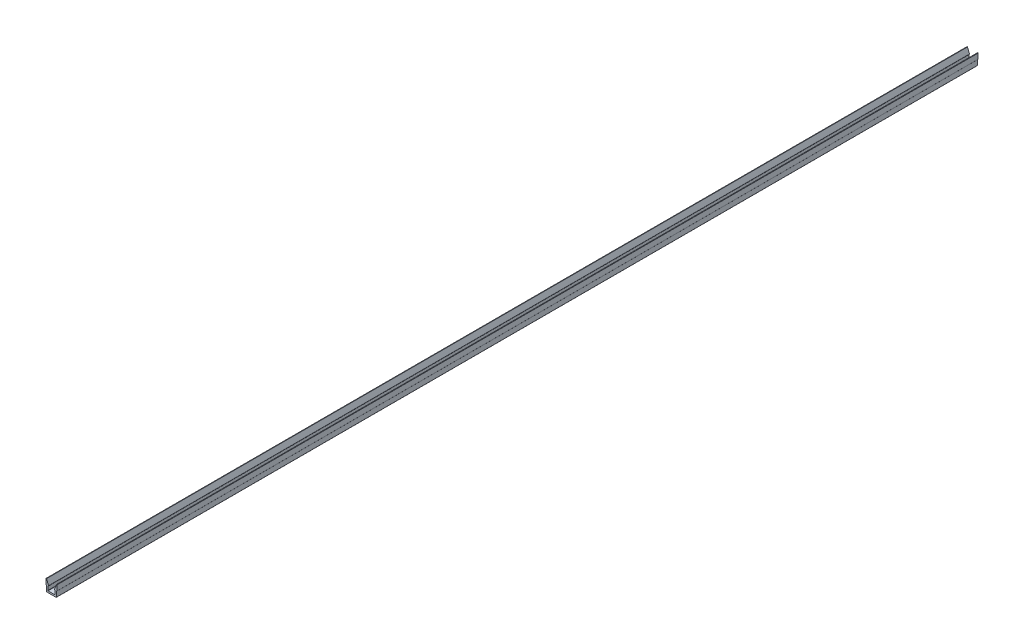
ISO-10303-21;
HEADER;
FILE_DESCRIPTION(('STEP AP214'),'2;1');
FILE_NAME('part.step','',(''),(''),'','','');
FILE_SCHEMA(('AUTOMOTIVE_DESIGN { 1 0 10303 214 1 1 1 1 }'));
ENDSEC;
DATA;
#1=APPLICATION_CONTEXT('core data for automotive mechanical design processes');
#2=APPLICATION_PROTOCOL_DEFINITION('international standard','automotive_design',2000,#1);
#3=PRODUCT_CONTEXT('',#1,'mechanical');
#4=PRODUCT('Part','Part','',(#3));
#5=PRODUCT_RELATED_PRODUCT_CATEGORY('part','',(#4));
#6=PRODUCT_DEFINITION_FORMATION('','',#4);
#7=PRODUCT_DEFINITION_CONTEXT('part definition',#1,'design');
#8=PRODUCT_DEFINITION('design','',#6,#7);
#9=PRODUCT_DEFINITION_SHAPE('','',#8);
#10=(LENGTH_UNIT() NAMED_UNIT(*) SI_UNIT(.MILLI.,.METRE.));
#11=(NAMED_UNIT(*) PLANE_ANGLE_UNIT() SI_UNIT($,.RADIAN.));
#12=(NAMED_UNIT(*) SI_UNIT($,.STERADIAN.) SOLID_ANGLE_UNIT());
#13=UNCERTAINTY_MEASURE_WITH_UNIT(LENGTH_MEASURE(1.E-05),#10,'distance_accuracy_value','');
#14=(GEOMETRIC_REPRESENTATION_CONTEXT(3) GLOBAL_UNCERTAINTY_ASSIGNED_CONTEXT((#13)) GLOBAL_UNIT_ASSIGNED_CONTEXT((#10,
#11,#12)) REPRESENTATION_CONTEXT('',''));
#15=CARTESIAN_POINT('',(0.,0.,0.));
#16=DIRECTION('',(0.,0.,1.));
#17=DIRECTION('',(1.,0.,0.));
#18=AXIS2_PLACEMENT_3D('',#15,#16,#17);
#19=CARTESIAN_POINT('',(2.032,3.175,508.));
#20=DIRECTION('',(1.,0.,0.));
#21=DIRECTION('',(0.,1.,0.));
#22=AXIS2_PLACEMENT_3D('',#19,#20,#21);
#23=PLANE('',#22);
#24=DIRECTION('',(0.,-1.,0.));
#25=VECTOR('',#24,1.);
#26=CARTESIAN_POINT('',(2.032,3.175,0.));
#27=LINE('',#26,#25);
#28=CARTESIAN_POINT('',(2.032,3.175,0.));
#29=VERTEX_POINT('',#28);
#30=CARTESIAN_POINT('',(2.032,1.016,0.));
#31=VERTEX_POINT('',#30);
#32=EDGE_CURVE('E214',#29,#31,#27,.T.);
#33=ORIENTED_EDGE('',*,*,#32,.T.);
#34=DIRECTION('',(0.,0.,-1.));
#35=VECTOR('',#34,1.);
#36=CARTESIAN_POINT('',(2.032,1.016,508.));
#37=LINE('',#36,#35);
#38=CARTESIAN_POINT('',(2.032,1.016,508.));
#39=VERTEX_POINT('',#38);
#40=EDGE_CURVE('E9',#39,#31,#37,.T.);
#41=ORIENTED_EDGE('',*,*,#40,.F.);
#42=DIRECTION('',(0.,-1.,0.));
#43=VECTOR('',#42,1.);
#44=CARTESIAN_POINT('',(2.032,3.175,508.));
#45=LINE('',#44,#43);
#46=CARTESIAN_POINT('',(2.032,3.175,508.));
#47=VERTEX_POINT('',#46);
#48=EDGE_CURVE('E285',#47,#39,#45,.T.);
#49=ORIENTED_EDGE('',*,*,#48,.F.);
#50=DIRECTION('',(0.,0.,-1.));
#51=VECTOR('',#50,1.);
#52=CARTESIAN_POINT('',(2.032,3.175,508.));
#53=LINE('',#52,#51);
#54=EDGE_CURVE('E227',#47,#29,#53,.T.);
#55=ORIENTED_EDGE('',*,*,#54,.T.);
#56=EDGE_LOOP('',(#33,#41,#49,#55));
#57=FACE_BOUND('',#56,.T.);
#58=ADVANCED_FACE('F14',(#57),#23,.F.);
#59=CARTESIAN_POINT('',(1.905,1.016,508.));
#60=DIRECTION('',(0.,0.,-1.));
#61=DIRECTION('',(-1.,0.,0.));
#62=AXIS2_PLACEMENT_3D('',#59,#60,#61);
#63=CYLINDRICAL_SURFACE('',#62,0.127);
#64=CARTESIAN_POINT('',(1.905,1.016,0.));
#65=DIRECTION('',(0.,0.,-1.));
#66=DIRECTION('',(-1.,0.,0.));
#67=AXIS2_PLACEMENT_3D('',#64,#65,#66);
#68=CIRCLE('',#67,0.127);
#69=CARTESIAN_POINT('',(1.905,0.889,0.));
#70=VERTEX_POINT('',#69);
#71=EDGE_CURVE('E210',#31,#70,#68,.T.);
#72=ORIENTED_EDGE('',*,*,#71,.T.);
#73=DIRECTION('',(0.,0.,-1.));
#74=VECTOR('',#73,1.);
#75=CARTESIAN_POINT('',(1.905,0.889,508.));
#76=LINE('',#75,#74);
#77=CARTESIAN_POINT('',(1.905,0.889,508.));
#78=VERTEX_POINT('',#77);
#79=EDGE_CURVE('E21',#78,#70,#76,.T.);
#80=ORIENTED_EDGE('',*,*,#79,.F.);
#81=CARTESIAN_POINT('',(1.905,1.016,508.));
#82=DIRECTION('',(0.,0.,-1.));
#83=DIRECTION('',(-1.,0.,0.));
#84=AXIS2_PLACEMENT_3D('',#81,#82,#83);
#85=CIRCLE('',#84,0.127);
#86=EDGE_CURVE('E223',#39,#78,#85,.T.);
#87=ORIENTED_EDGE('',*,*,#86,.F.);
#88=ORIENTED_EDGE('',*,*,#40,.T.);
#89=EDGE_LOOP('',(#72,#80,#87,#88));
#90=FACE_BOUND('',#89,.T.);
#91=ADVANCED_FACE('F222',(#90),#63,.F.);
#92=CARTESIAN_POINT('',(1.905,0.889,508.));
#93=DIRECTION('',(0.,-1.,0.));
#94=DIRECTION('',(0.,0.,-1.));
#95=AXIS2_PLACEMENT_3D('',#92,#93,#94);
#96=PLANE('',#95);
#97=DIRECTION('',(-1.,0.,0.));
#98=VECTOR('',#97,1.);
#99=CARTESIAN_POINT('',(1.905,0.889,0.));
#100=LINE('',#99,#98);
#101=CARTESIAN_POINT('',(-1.905,0.889,0.));
#102=VERTEX_POINT('',#101);
#103=EDGE_CURVE('E216',#70,#102,#100,.T.);
#104=ORIENTED_EDGE('',*,*,#103,.T.);
#105=DIRECTION('',(0.,0.,-1.));
#106=VECTOR('',#105,1.);
#107=CARTESIAN_POINT('',(-1.905,0.889,508.));
#108=LINE('',#107,#106);
#109=CARTESIAN_POINT('',(-1.905,0.889,508.));
#110=VERTEX_POINT('',#109);
#111=EDGE_CURVE('E421',#110,#102,#108,.T.);
#112=ORIENTED_EDGE('',*,*,#111,.F.);
#113=DIRECTION('',(-1.,0.,0.));
#114=VECTOR('',#113,1.);
#115=CARTESIAN_POINT('',(1.905,0.889,508.));
#116=LINE('',#115,#114);
#117=EDGE_CURVE('E288',#78,#110,#116,.T.);
#118=ORIENTED_EDGE('',*,*,#117,.F.);
#119=ORIENTED_EDGE('',*,*,#79,.T.);
#120=EDGE_LOOP('',(#104,#112,#118,#119));
#121=FACE_BOUND('',#120,.T.);
#122=ADVANCED_FACE('F425',(#121),#96,.F.);
#123=CARTESIAN_POINT('',(-1.905,1.016,508.));
#124=DIRECTION('',(0.,0.,-1.));
#125=DIRECTION('',(-1.,0.,0.));
#126=AXIS2_PLACEMENT_3D('',#123,#124,#125);
#127=CYLINDRICAL_SURFACE('',#126,0.127);
#128=CARTESIAN_POINT('',(-1.905,1.016,0.));
#129=DIRECTION('',(0.,0.,-1.));
#130=DIRECTION('',(1.,0.,0.));
#131=AXIS2_PLACEMENT_3D('',#128,#129,#130);
#132=CIRCLE('',#131,0.127);
#133=CARTESIAN_POINT('',(-2.032,1.016,0.));
#134=VERTEX_POINT('',#133);
#135=EDGE_CURVE('E231',#102,#134,#132,.T.);
#136=ORIENTED_EDGE('',*,*,#135,.T.);
#137=DIRECTION('',(0.,0.,-1.));
#138=VECTOR('',#137,1.);
#139=CARTESIAN_POINT('',(-2.032,1.016,508.));
#140=LINE('',#139,#138);
#141=CARTESIAN_POINT('',(-2.032,1.016,508.));
#142=VERTEX_POINT('',#141);
#143=EDGE_CURVE('E418',#142,#134,#140,.T.);
#144=ORIENTED_EDGE('',*,*,#143,.F.);
#145=CARTESIAN_POINT('',(-1.905,1.016,508.));
#146=DIRECTION('',(0.,0.,-1.));
#147=DIRECTION('',(1.,0.,0.));
#148=AXIS2_PLACEMENT_3D('',#145,#146,#147);
#149=CIRCLE('',#148,0.127);
#150=EDGE_CURVE('E290',#110,#142,#149,.T.);
#151=ORIENTED_EDGE('',*,*,#150,.F.);
#152=ORIENTED_EDGE('',*,*,#111,.T.);
#153=EDGE_LOOP('',(#136,#144,#151,#152));
#154=FACE_BOUND('',#153,.T.);
#155=ADVANCED_FACE('F433',(#154),#127,.F.);
#156=CARTESIAN_POINT('',(-2.032,3.175,508.));
#157=DIRECTION('',(-1.,0.,0.));
#158=DIRECTION('',(0.,-1.,0.));
#159=AXIS2_PLACEMENT_3D('',#156,#157,#158);
#160=PLANE('',#159);
#161=DIRECTION('',(0.,1.,0.));
#162=VECTOR('',#161,1.);
#163=CARTESIAN_POINT('',(-2.032,3.175,0.));
#164=LINE('',#163,#162);
#165=CARTESIAN_POINT('',(-2.032,3.175,0.));
#166=VERTEX_POINT('',#165);
#167=EDGE_CURVE('E233',#134,#166,#164,.T.);
#168=ORIENTED_EDGE('',*,*,#167,.T.);
#169=DIRECTION('',(0.,0.,-1.));
#170=VECTOR('',#169,1.);
#171=CARTESIAN_POINT('',(-2.032,3.175,508.));
#172=LINE('',#171,#170);
#173=CARTESIAN_POINT('',(-2.032,3.175,508.));
#174=VERTEX_POINT('',#173);
#175=EDGE_CURVE('E415',#174,#166,#172,.T.);
#176=ORIENTED_EDGE('',*,*,#175,.F.);
#177=DIRECTION('',(0.,1.,0.));
#178=VECTOR('',#177,1.);
#179=CARTESIAN_POINT('',(-2.032,3.175,508.));
#180=LINE('',#179,#178);
#181=EDGE_CURVE('E292',#142,#174,#180,.T.);
#182=ORIENTED_EDGE('',*,*,#181,.F.);
#183=ORIENTED_EDGE('',*,*,#143,.T.);
#184=EDGE_LOOP('',(#168,#176,#182,#183));
#185=FACE_BOUND('',#184,.T.);
#186=ADVANCED_FACE('F436',(#185),#160,.F.);
#187=CARTESIAN_POINT('',(-1.88778721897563,3.175,508.));
#188=DIRECTION('',(0.,1.,0.));
#189=DIRECTION('',(-1.,0.,0.));
#190=AXIS2_PLACEMENT_3D('',#187,#188,#189);
#191=PLANE('',#190);
#192=DIRECTION('',(1.,0.,0.));
#193=VECTOR('',#192,1.);
#194=CARTESIAN_POINT('',(-1.88778721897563,3.175,0.));
#195=LINE('',#194,#193);
#196=CARTESIAN_POINT('',(-1.88778721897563,3.175,0.));
#197=VERTEX_POINT('',#196);
#198=EDGE_CURVE('E235',#166,#197,#195,.T.);
#199=ORIENTED_EDGE('',*,*,#198,.T.);
#200=DIRECTION('',(0.,0.,-1.));
#201=VECTOR('',#200,1.);
#202=CARTESIAN_POINT('',(-1.88778721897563,3.175,508.));
#203=LINE('',#202,#201);
#204=CARTESIAN_POINT('',(-1.88778721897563,3.175,508.));
#205=VERTEX_POINT('',#204);
#206=EDGE_CURVE('E412',#205,#197,#203,.T.);
#207=ORIENTED_EDGE('',*,*,#206,.F.);
#208=DIRECTION('',(1.,0.,0.));
#209=VECTOR('',#208,1.);
#210=CARTESIAN_POINT('',(-1.88778721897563,3.175,508.));
#211=LINE('',#210,#209);
#212=EDGE_CURVE('E294',#174,#205,#211,.T.);
#213=ORIENTED_EDGE('',*,*,#212,.F.);
#214=ORIENTED_EDGE('',*,*,#175,.T.);
#215=EDGE_LOOP('',(#199,#207,#213,#214));
#216=FACE_BOUND('',#215,.T.);
#217=ADVANCED_FACE('F441',(#216),#191,.F.);
#218=CARTESIAN_POINT('',(-1.88778721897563,3.429,508.));
#219=DIRECTION('',(0.,0.,-1.));
#220=DIRECTION('',(-1.,0.,0.));
#221=AXIS2_PLACEMENT_3D('',#218,#219,#220);
#222=CYLINDRICAL_SURFACE('',#221,0.254);
#223=CARTESIAN_POINT('',(-1.88778721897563,3.429,0.));
#224=DIRECTION('',(0.,0.,1.));
#225=DIRECTION('',(-1.,0.,0.));
#226=AXIS2_PLACEMENT_3D('',#223,#224,#225);
#227=CIRCLE('',#226,0.254);
#228=CARTESIAN_POINT('',(-1.65228251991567,3.52415007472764,0.));
#229=VERTEX_POINT('',#228);
#230=EDGE_CURVE('E237',#197,#229,#227,.T.);
#231=ORIENTED_EDGE('',*,*,#230,.T.);
#232=DIRECTION('',(0.,0.,-1.));
#233=VECTOR('',#232,1.);
#234=CARTESIAN_POINT('',(-1.65228251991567,3.52415007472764,508.));
#235=LINE('',#234,#233);
#236=CARTESIAN_POINT('',(-1.65228251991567,3.52415007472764,508.));
#237=VERTEX_POINT('',#236);
#238=EDGE_CURVE('E409',#237,#229,#235,.T.);
#239=ORIENTED_EDGE('',*,*,#238,.F.);
#240=CARTESIAN_POINT('',(-1.88778721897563,3.429,508.));
#241=DIRECTION('',(0.,0.,1.));
#242=DIRECTION('',(-1.,0.,0.));
#243=AXIS2_PLACEMENT_3D('',#240,#241,#242);
#244=CIRCLE('',#243,0.254);
#245=EDGE_CURVE('E296',#205,#237,#244,.T.);
#246=ORIENTED_EDGE('',*,*,#245,.F.);
#247=ORIENTED_EDGE('',*,*,#206,.T.);
#248=EDGE_LOOP('',(#231,#239,#246,#247));
#249=FACE_BOUND('',#248,.T.);
#250=ADVANCED_FACE('F447',(#249),#222,.T.);
#251=CARTESIAN_POINT('',(-2.76191023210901,6.27057503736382,508.));
#252=DIRECTION('',(-0.92718385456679,-0.374606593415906,0.));
#253=DIRECTION('',(0.374606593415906,-0.92718385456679,0.));
#254=AXIS2_PLACEMENT_3D('',#251,#252,#253);
#255=PLANE('',#254);
#256=DIRECTION('',(-0.374606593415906,0.92718385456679,0.));
#257=VECTOR('',#256,1.);
#258=CARTESIAN_POINT('',(-2.76191023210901,6.27057503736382,0.));
#259=LINE('',#258,#257);
#260=CARTESIAN_POINT('',(-2.76191023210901,6.27057503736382,0.));
#261=VERTEX_POINT('',#260);
#262=EDGE_CURVE('E239',#229,#261,#259,.T.);
#263=ORIENTED_EDGE('',*,*,#262,.T.);
#264=DIRECTION('',(0.,0.,-1.));
#265=VECTOR('',#264,1.);
#266=CARTESIAN_POINT('',(-2.76191023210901,6.27057503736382,508.));
#267=LINE('',#266,#265);
#268=CARTESIAN_POINT('',(-2.76191023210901,6.27057503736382,508.));
#269=VERTEX_POINT('',#268);
#270=EDGE_CURVE('E406',#269,#261,#267,.T.);
#271=ORIENTED_EDGE('',*,*,#270,.F.);
#272=DIRECTION('',(-0.374606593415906,0.92718385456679,0.));
#273=VECTOR('',#272,1.);
#274=CARTESIAN_POINT('',(-2.76191023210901,6.27057503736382,508.));
#275=LINE('',#274,#273);
#276=EDGE_CURVE('E298',#237,#269,#275,.T.);
#277=ORIENTED_EDGE('',*,*,#276,.F.);
#278=ORIENTED_EDGE('',*,*,#238,.T.);
#279=EDGE_LOOP('',(#263,#271,#277,#278));
#280=FACE_BOUND('',#279,.T.);
#281=ADVANCED_FACE('F451',(#280),#255,.F.);
#282=CARTESIAN_POINT('',(-2.87966258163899,6.223,508.));
#283=DIRECTION('',(0.,0.,-1.));
#284=DIRECTION('',(-1.,0.,0.));
#285=AXIS2_PLACEMENT_3D('',#282,#283,#284);
#286=CYLINDRICAL_SURFACE('',#285,0.127);
#287=CARTESIAN_POINT('',(-2.87966258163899,6.223,0.));
#288=DIRECTION('',(0.,0.,1.));
#289=DIRECTION('',(-1.,0.,0.));
#290=AXIS2_PLACEMENT_3D('',#287,#288,#289);
#291=CIRCLE('',#290,0.127);
#292=CARTESIAN_POINT('',(-2.87966258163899,6.35,0.));
#293=VERTEX_POINT('',#292);
#294=EDGE_CURVE('E241',#261,#293,#291,.T.);
#295=ORIENTED_EDGE('',*,*,#294,.T.);
#296=DIRECTION('',(0.,0.,-1.));
#297=VECTOR('',#296,1.);
#298=CARTESIAN_POINT('',(-2.87966258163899,6.35,508.));
#299=LINE('',#298,#297);
#300=CARTESIAN_POINT('',(-2.87966258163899,6.35,508.));
#301=VERTEX_POINT('',#300);
#302=EDGE_CURVE('E403',#301,#293,#299,.T.);
#303=ORIENTED_EDGE('',*,*,#302,.F.);
#304=CARTESIAN_POINT('',(-2.87966258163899,6.223,508.));
#305=DIRECTION('',(0.,0.,1.));
#306=DIRECTION('',(-1.,0.,0.));
#307=AXIS2_PLACEMENT_3D('',#304,#305,#306);
#308=CIRCLE('',#307,0.127);
#309=EDGE_CURVE('E300',#269,#301,#308,.T.);
#310=ORIENTED_EDGE('',*,*,#309,.F.);
#311=ORIENTED_EDGE('',*,*,#270,.T.);
#312=EDGE_LOOP('',(#295,#303,#310,#311));
#313=FACE_BOUND('',#312,.T.);
#314=ADVANCED_FACE('F456',(#313),#286,.T.);
#315=CARTESIAN_POINT('',(-2.921,6.35,508.));
#316=DIRECTION('',(0.,-1.,0.));
#317=DIRECTION('',(1.,0.,0.));
#318=AXIS2_PLACEMENT_3D('',#315,#316,#317);
#319=PLANE('',#318);
#320=DIRECTION('',(-1.,0.,0.));
#321=VECTOR('',#320,1.);
#322=CARTESIAN_POINT('',(-2.921,6.35,0.));
#323=LINE('',#322,#321);
#324=CARTESIAN_POINT('',(-2.921,6.35,0.));
#325=VERTEX_POINT('',#324);
#326=EDGE_CURVE('E243',#293,#325,#323,.T.);
#327=ORIENTED_EDGE('',*,*,#326,.T.);
#328=DIRECTION('',(0.,0.,-1.));
#329=VECTOR('',#328,1.);
#330=CARTESIAN_POINT('',(-2.921,6.35,508.));
#331=LINE('',#330,#329);
#332=CARTESIAN_POINT('',(-2.921,6.35,508.));
#333=VERTEX_POINT('',#332);
#334=EDGE_CURVE('E400',#333,#325,#331,.T.);
#335=ORIENTED_EDGE('',*,*,#334,.F.);
#336=DIRECTION('',(-1.,0.,0.));
#337=VECTOR('',#336,1.);
#338=CARTESIAN_POINT('',(-2.921,6.35,508.));
#339=LINE('',#338,#337);
#340=EDGE_CURVE('E302',#301,#333,#339,.T.);
#341=ORIENTED_EDGE('',*,*,#340,.F.);
#342=ORIENTED_EDGE('',*,*,#302,.T.);
#343=EDGE_LOOP('',(#327,#335,#341,#342));
#344=FACE_BOUND('',#343,.T.);
#345=ADVANCED_FACE('F462',(#344),#319,.F.);
#346=CARTESIAN_POINT('',(-2.921,6.223,508.));
#347=DIRECTION('',(0.,0.,-1.));
#348=DIRECTION('',(-1.,0.,0.));
#349=AXIS2_PLACEMENT_3D('',#346,#347,#348);
#350=CYLINDRICAL_SURFACE('',#349,0.127);
#351=CARTESIAN_POINT('',(-2.921,6.223,0.));
#352=DIRECTION('',(0.,0.,1.));
#353=DIRECTION('',(-1.,0.,0.));
#354=AXIS2_PLACEMENT_3D('',#351,#352,#353);
#355=CIRCLE('',#354,0.127);
#356=CARTESIAN_POINT('',(-3.048,6.223,0.));
#357=VERTEX_POINT('',#356);
#358=EDGE_CURVE('E245',#325,#357,#355,.T.);
#359=ORIENTED_EDGE('',*,*,#358,.T.);
#360=DIRECTION('',(0.,0.,-1.));
#361=VECTOR('',#360,1.);
#362=CARTESIAN_POINT('',(-3.048,6.223,508.));
#363=LINE('',#362,#361);
#364=CARTESIAN_POINT('',(-3.048,6.223,508.));
#365=VERTEX_POINT('',#364);
#366=EDGE_CURVE('E397',#365,#357,#363,.T.);
#367=ORIENTED_EDGE('',*,*,#366,.F.);
#368=CARTESIAN_POINT('',(-2.921,6.223,508.));
#369=DIRECTION('',(0.,0.,1.));
#370=DIRECTION('',(-1.,0.,0.));
#371=AXIS2_PLACEMENT_3D('',#368,#369,#370);
#372=CIRCLE('',#371,0.127);
#373=EDGE_CURVE('E304',#333,#365,#372,.T.);
#374=ORIENTED_EDGE('',*,*,#373,.F.);
#375=ORIENTED_EDGE('',*,*,#334,.T.);
#376=EDGE_LOOP('',(#359,#367,#374,#375));
#377=FACE_BOUND('',#376,.T.);
#378=ADVANCED_FACE('F466',(#377),#350,.T.);
#379=CARTESIAN_POINT('',(-3.048,3.302,508.));
#380=DIRECTION('',(1.,0.,0.));
#381=DIRECTION('',(0.,1.,0.));
#382=AXIS2_PLACEMENT_3D('',#379,#380,#381);
#383=PLANE('',#382);
#384=DIRECTION('',(0.,-1.,0.));
#385=VECTOR('',#384,1.);
#386=CARTESIAN_POINT('',(-3.048,3.302,0.));
#387=LINE('',#386,#385);
#388=CARTESIAN_POINT('',(-3.048,3.302,0.));
#389=VERTEX_POINT('',#388);
#390=EDGE_CURVE('E247',#357,#389,#387,.T.);
#391=ORIENTED_EDGE('',*,*,#390,.T.);
#392=DIRECTION('',(0.,0.,-1.));
#393=VECTOR('',#392,1.);
#394=CARTESIAN_POINT('',(-3.048,3.302,508.));
#395=LINE('',#394,#393);
#396=CARTESIAN_POINT('',(-3.048,3.302,508.));
#397=VERTEX_POINT('',#396);
#398=EDGE_CURVE('E394',#397,#389,#395,.T.);
#399=ORIENTED_EDGE('',*,*,#398,.F.);
#400=DIRECTION('',(0.,-1.,0.));
#401=VECTOR('',#400,1.);
#402=CARTESIAN_POINT('',(-3.048,3.302,508.));
#403=LINE('',#402,#401);
#404=EDGE_CURVE('E306',#365,#397,#403,.T.);
#405=ORIENTED_EDGE('',*,*,#404,.F.);
#406=ORIENTED_EDGE('',*,*,#366,.T.);
#407=EDGE_LOOP('',(#391,#399,#405,#406));
#408=FACE_BOUND('',#407,.T.);
#409=ADVANCED_FACE('F471',(#408),#383,.F.);
#410=CARTESIAN_POINT('',(-2.921,3.302,508.));
#411=DIRECTION('',(0.,0.,-1.));
#412=DIRECTION('',(-1.,0.,0.));
#413=AXIS2_PLACEMENT_3D('',#410,#411,#412);
#414=CYLINDRICAL_SURFACE('',#413,0.127);
#415=CARTESIAN_POINT('',(-2.921,3.302,0.));
#416=DIRECTION('',(0.,0.,1.));
#417=DIRECTION('',(-1.,0.,0.));
#418=AXIS2_PLACEMENT_3D('',#415,#416,#417);
#419=CIRCLE('',#418,0.127);
#420=CARTESIAN_POINT('',(-2.921,3.175,0.));
#421=VERTEX_POINT('',#420);
#422=EDGE_CURVE('E249',#389,#421,#419,.T.);
#423=ORIENTED_EDGE('',*,*,#422,.T.);
#424=DIRECTION('',(0.,0.,-1.));
#425=VECTOR('',#424,1.);
#426=CARTESIAN_POINT('',(-2.921,3.175,508.));
#427=LINE('',#426,#425);
#428=CARTESIAN_POINT('',(-2.921,3.175,508.));
#429=VERTEX_POINT('',#428);
#430=EDGE_CURVE('E391',#429,#421,#427,.T.);
#431=ORIENTED_EDGE('',*,*,#430,.F.);
#432=CARTESIAN_POINT('',(-2.921,3.302,508.));
#433=DIRECTION('',(0.,0.,1.));
#434=DIRECTION('',(-1.,0.,0.));
#435=AXIS2_PLACEMENT_3D('',#432,#433,#434);
#436=CIRCLE('',#435,0.127);
#437=EDGE_CURVE('E308',#397,#429,#436,.T.);
#438=ORIENTED_EDGE('',*,*,#437,.F.);
#439=ORIENTED_EDGE('',*,*,#398,.T.);
#440=EDGE_LOOP('',(#423,#431,#438,#439));
#441=FACE_BOUND('',#440,.T.);
#442=ADVANCED_FACE('F477',(#441),#414,.T.);
#443=CARTESIAN_POINT('',(-2.794,3.175,508.));
#444=DIRECTION('',(0.,1.,0.));
#445=DIRECTION('',(-1.,0.,0.));
#446=AXIS2_PLACEMENT_3D('',#443,#444,#445);
#447=PLANE('',#446);
#448=DIRECTION('',(1.,0.,0.));
#449=VECTOR('',#448,1.);
#450=CARTESIAN_POINT('',(-2.794,3.175,0.));
#451=LINE('',#450,#449);
#452=CARTESIAN_POINT('',(-2.794,3.175,0.));
#453=VERTEX_POINT('',#452);
#454=EDGE_CURVE('E251',#421,#453,#451,.T.);
#455=ORIENTED_EDGE('',*,*,#454,.T.);
#456=DIRECTION('',(0.,0.,-1.));
#457=VECTOR('',#456,1.);
#458=CARTESIAN_POINT('',(-2.794,3.175,508.));
#459=LINE('',#458,#457);
#460=CARTESIAN_POINT('',(-2.794,3.175,508.));
#461=VERTEX_POINT('',#460);
#462=EDGE_CURVE('E388',#461,#453,#459,.T.);
#463=ORIENTED_EDGE('',*,*,#462,.F.);
#464=DIRECTION('',(1.,0.,0.));
#465=VECTOR('',#464,1.);
#466=CARTESIAN_POINT('',(-2.794,3.175,508.));
#467=LINE('',#466,#465);
#468=EDGE_CURVE('E310',#429,#461,#467,.T.);
#469=ORIENTED_EDGE('',*,*,#468,.F.);
#470=ORIENTED_EDGE('',*,*,#430,.T.);
#471=EDGE_LOOP('',(#455,#463,#469,#470));
#472=FACE_BOUND('',#471,.T.);
#473=ADVANCED_FACE('F481',(#472),#447,.F.);
#474=CARTESIAN_POINT('',(-2.794,3.048,508.));
#475=DIRECTION('',(0.,0.,-1.));
#476=DIRECTION('',(-1.,0.,0.));
#477=AXIS2_PLACEMENT_3D('',#474,#475,#476);
#478=CYLINDRICAL_SURFACE('',#477,0.127);
#479=CARTESIAN_POINT('',(-2.794,3.048,0.));
#480=DIRECTION('',(0.,0.,-1.));
#481=DIRECTION('',(1.,0.,0.));
#482=AXIS2_PLACEMENT_3D('',#479,#480,#481);
#483=CIRCLE('',#482,0.127);
#484=CARTESIAN_POINT('',(-2.667,3.048,0.));
#485=VERTEX_POINT('',#484);
#486=EDGE_CURVE('E253',#453,#485,#483,.T.);
#487=ORIENTED_EDGE('',*,*,#486,.T.);
#488=DIRECTION('',(0.,0.,-1.));
#489=VECTOR('',#488,1.);
#490=CARTESIAN_POINT('',(-2.667,3.048,508.));
#491=LINE('',#490,#489);
#492=CARTESIAN_POINT('',(-2.667,3.048,508.));
#493=VERTEX_POINT('',#492);
#494=EDGE_CURVE('E385',#493,#485,#491,.T.);
#495=ORIENTED_EDGE('',*,*,#494,.F.);
#496=CARTESIAN_POINT('',(-2.794,3.048,508.));
#497=DIRECTION('',(0.,0.,-1.));
#498=DIRECTION('',(1.,0.,0.));
#499=AXIS2_PLACEMENT_3D('',#496,#497,#498);
#500=CIRCLE('',#499,0.127);
#501=EDGE_CURVE('E312',#461,#493,#500,.T.);
#502=ORIENTED_EDGE('',*,*,#501,.F.);
#503=ORIENTED_EDGE('',*,*,#462,.T.);
#504=EDGE_LOOP('',(#487,#495,#502,#503));
#505=FACE_BOUND('',#504,.T.);
#506=ADVANCED_FACE('F486',(#505),#478,.F.);
#507=CARTESIAN_POINT('',(-2.667,0.127,508.));
#508=DIRECTION('',(1.,0.,0.));
#509=DIRECTION('',(0.,0.,-1.));
#510=AXIS2_PLACEMENT_3D('',#507,#508,#509);
#511=PLANE('',#510);
#512=DIRECTION('',(0.,-1.,0.));
#513=VECTOR('',#512,1.);
#514=CARTESIAN_POINT('',(-2.667,0.127,0.));
#515=LINE('',#514,#513);
#516=CARTESIAN_POINT('',(-2.667,0.127,0.));
#517=VERTEX_POINT('',#516);
#518=EDGE_CURVE('E255',#485,#517,#515,.T.);
#519=ORIENTED_EDGE('',*,*,#518,.T.);
#520=DIRECTION('',(0.,0.,-1.));
#521=VECTOR('',#520,1.);
#522=CARTESIAN_POINT('',(-2.667,0.127,508.));
#523=LINE('',#522,#521);
#524=CARTESIAN_POINT('',(-2.667,0.127,508.));
#525=VERTEX_POINT('',#524);
#526=EDGE_CURVE('E382',#525,#517,#523,.T.);
#527=ORIENTED_EDGE('',*,*,#526,.F.);
#528=DIRECTION('',(0.,-1.,0.));
#529=VECTOR('',#528,1.);
#530=CARTESIAN_POINT('',(-2.667,0.127,508.));
#531=LINE('',#530,#529);
#532=EDGE_CURVE('E314',#493,#525,#531,.T.);
#533=ORIENTED_EDGE('',*,*,#532,.F.);
#534=ORIENTED_EDGE('',*,*,#494,.T.);
#535=EDGE_LOOP('',(#519,#527,#533,#534));
#536=FACE_BOUND('',#535,.T.);
#537=ADVANCED_FACE('F492',(#536),#511,.F.);
#538=CARTESIAN_POINT('',(-2.54,0.127,508.));
#539=DIRECTION('',(0.,0.,-1.));
#540=DIRECTION('',(-1.,0.,0.));
#541=AXIS2_PLACEMENT_3D('',#538,#539,#540);
#542=CYLINDRICAL_SURFACE('',#541,0.127);
#543=CARTESIAN_POINT('',(-2.54,0.127,0.));
#544=DIRECTION('',(0.,0.,1.));
#545=DIRECTION('',(-1.,0.,0.));
#546=AXIS2_PLACEMENT_3D('',#543,#544,#545);
#547=CIRCLE('',#546,0.127);
#548=CARTESIAN_POINT('',(-2.54,0.,0.));
#549=VERTEX_POINT('',#548);
#550=EDGE_CURVE('E257',#517,#549,#547,.T.);
#551=ORIENTED_EDGE('',*,*,#550,.T.);
#552=DIRECTION('',(0.,0.,-1.));
#553=VECTOR('',#552,1.);
#554=CARTESIAN_POINT('',(-2.54,0.,508.));
#555=LINE('',#554,#553);
#556=CARTESIAN_POINT('',(-2.54,0.,508.));
#557=VERTEX_POINT('',#556);
#558=EDGE_CURVE('E379',#557,#549,#555,.T.);
#559=ORIENTED_EDGE('',*,*,#558,.F.);
#560=CARTESIAN_POINT('',(-2.54,0.127,508.));
#561=DIRECTION('',(0.,0.,1.));
#562=DIRECTION('',(-1.,0.,0.));
#563=AXIS2_PLACEMENT_3D('',#560,#561,#562);
#564=CIRCLE('',#563,0.127);
#565=EDGE_CURVE('E316',#525,#557,#564,.T.);
#566=ORIENTED_EDGE('',*,*,#565,.F.);
#567=ORIENTED_EDGE('',*,*,#526,.T.);
#568=EDGE_LOOP('',(#551,#559,#566,#567));
#569=FACE_BOUND('',#568,.T.);
#570=ADVANCED_FACE('F496',(#569),#542,.T.);
#571=CARTESIAN_POINT('',(-2.54,0.,508.));
#572=DIRECTION('',(0.,1.,0.));
#573=DIRECTION('',(0.,0.,1.));
#574=AXIS2_PLACEMENT_3D('',#571,#572,#573);
#575=PLANE('',#574);
#576=DIRECTION('',(1.,0.,0.));
#577=VECTOR('',#576,1.);
#578=CARTESIAN_POINT('',(-2.54,0.,0.));
#579=LINE('',#578,#577);
#580=CARTESIAN_POINT('',(2.54,0.,0.));
#581=VERTEX_POINT('',#580);
#582=EDGE_CURVE('E259',#549,#581,#579,.T.);
#583=ORIENTED_EDGE('',*,*,#582,.T.);
#584=DIRECTION('',(0.,0.,-1.));
#585=VECTOR('',#584,1.);
#586=CARTESIAN_POINT('',(2.54,0.,508.));
#587=LINE('',#586,#585);
#588=CARTESIAN_POINT('',(2.54,0.,508.));
#589=VERTEX_POINT('',#588);
#590=EDGE_CURVE('E376',#589,#581,#587,.T.);
#591=ORIENTED_EDGE('',*,*,#590,.F.);
#592=DIRECTION('',(1.,0.,0.));
#593=VECTOR('',#592,1.);
#594=CARTESIAN_POINT('',(-2.54,0.,508.));
#595=LINE('',#594,#593);
#596=EDGE_CURVE('E318',#557,#589,#595,.T.);
#597=ORIENTED_EDGE('',*,*,#596,.F.);
#598=ORIENTED_EDGE('',*,*,#558,.T.);
#599=EDGE_LOOP('',(#583,#591,#597,#598));
#600=FACE_BOUND('',#599,.T.);
#601=ADVANCED_FACE('F501',(#600),#575,.F.);
#602=CARTESIAN_POINT('',(2.54,0.127,508.));
#603=DIRECTION('',(0.,0.,-1.));
#604=DIRECTION('',(-1.,0.,0.));
#605=AXIS2_PLACEMENT_3D('',#602,#603,#604);
#606=CYLINDRICAL_SURFACE('',#605,0.127);
#607=CARTESIAN_POINT('',(2.54,0.127,0.));
#608=DIRECTION('',(0.,0.,1.));
#609=DIRECTION('',(1.,0.,0.));
#610=AXIS2_PLACEMENT_3D('',#607,#608,#609);
#611=CIRCLE('',#610,0.127);
#612=CARTESIAN_POINT('',(2.667,0.127,0.));
#613=VERTEX_POINT('',#612);
#614=EDGE_CURVE('E261',#581,#613,#611,.T.);
#615=ORIENTED_EDGE('',*,*,#614,.T.);
#616=DIRECTION('',(0.,0.,-1.));
#617=VECTOR('',#616,1.);
#618=CARTESIAN_POINT('',(2.667,0.127,508.));
#619=LINE('',#618,#617);
#620=CARTESIAN_POINT('',(2.667,0.127,508.));
#621=VERTEX_POINT('',#620);
#622=EDGE_CURVE('E373',#621,#613,#619,.T.);
#623=ORIENTED_EDGE('',*,*,#622,.F.);
#624=CARTESIAN_POINT('',(2.54,0.127,508.));
#625=DIRECTION('',(0.,0.,1.));
#626=DIRECTION('',(1.,0.,0.));
#627=AXIS2_PLACEMENT_3D('',#624,#625,#626);
#628=CIRCLE('',#627,0.127);
#629=EDGE_CURVE('E320',#589,#621,#628,.T.);
#630=ORIENTED_EDGE('',*,*,#629,.F.);
#631=ORIENTED_EDGE('',*,*,#590,.T.);
#632=EDGE_LOOP('',(#615,#623,#630,#631));
#633=FACE_BOUND('',#632,.T.);
#634=ADVANCED_FACE('F507',(#633),#606,.T.);
#635=CARTESIAN_POINT('',(2.667,0.127,508.));
#636=DIRECTION('',(-1.,0.,0.));
#637=DIRECTION('',(0.,0.,1.));
#638=AXIS2_PLACEMENT_3D('',#635,#636,#637);
#639=PLANE('',#638);
#640=DIRECTION('',(0.,1.,0.));
#641=VECTOR('',#640,1.);
#642=CARTESIAN_POINT('',(2.667,0.127,0.));
#643=LINE('',#642,#641);
#644=CARTESIAN_POINT('',(2.667,3.048,0.));
#645=VERTEX_POINT('',#644);
#646=EDGE_CURVE('E263',#613,#645,#643,.T.);
#647=ORIENTED_EDGE('',*,*,#646,.T.);
#648=DIRECTION('',(0.,0.,-1.));
#649=VECTOR('',#648,1.);
#650=CARTESIAN_POINT('',(2.667,3.048,508.));
#651=LINE('',#650,#649);
#652=CARTESIAN_POINT('',(2.667,3.048,508.));
#653=VERTEX_POINT('',#652);
#654=EDGE_CURVE('E370',#653,#645,#651,.T.);
#655=ORIENTED_EDGE('',*,*,#654,.F.);
#656=DIRECTION('',(0.,1.,0.));
#657=VECTOR('',#656,1.);
#658=CARTESIAN_POINT('',(2.667,0.127,508.));
#659=LINE('',#658,#657);
#660=EDGE_CURVE('E322',#621,#653,#659,.T.);
#661=ORIENTED_EDGE('',*,*,#660,.F.);
#662=ORIENTED_EDGE('',*,*,#622,.T.);
#663=EDGE_LOOP('',(#647,#655,#661,#662));
#664=FACE_BOUND('',#663,.T.);
#665=ADVANCED_FACE('F511',(#664),#639,.F.);
#666=CARTESIAN_POINT('',(2.794,3.048,508.));
#667=DIRECTION('',(0.,0.,-1.));
#668=DIRECTION('',(-1.,0.,0.));
#669=AXIS2_PLACEMENT_3D('',#666,#667,#668);
#670=CYLINDRICAL_SURFACE('',#669,0.127);
#671=CARTESIAN_POINT('',(2.794,3.048,0.));
#672=DIRECTION('',(0.,0.,-1.));
#673=DIRECTION('',(-1.,0.,0.));
#674=AXIS2_PLACEMENT_3D('',#671,#672,#673);
#675=CIRCLE('',#674,0.127);
#676=CARTESIAN_POINT('',(2.794,3.175,0.));
#677=VERTEX_POINT('',#676);
#678=EDGE_CURVE('E265',#645,#677,#675,.T.);
#679=ORIENTED_EDGE('',*,*,#678,.T.);
#680=DIRECTION('',(0.,0.,-1.));
#681=VECTOR('',#680,1.);
#682=CARTESIAN_POINT('',(2.794,3.175,508.));
#683=LINE('',#682,#681);
#684=CARTESIAN_POINT('',(2.794,3.175,508.));
#685=VERTEX_POINT('',#684);
#686=EDGE_CURVE('E367',#685,#677,#683,.T.);
#687=ORIENTED_EDGE('',*,*,#686,.F.);
#688=CARTESIAN_POINT('',(2.794,3.048,508.));
#689=DIRECTION('',(0.,0.,-1.));
#690=DIRECTION('',(-1.,0.,0.));
#691=AXIS2_PLACEMENT_3D('',#688,#689,#690);
#692=CIRCLE('',#691,0.127);
#693=EDGE_CURVE('E324',#653,#685,#692,.T.);
#694=ORIENTED_EDGE('',*,*,#693,.F.);
#695=ORIENTED_EDGE('',*,*,#654,.T.);
#696=EDGE_LOOP('',(#679,#687,#694,#695));
#697=FACE_BOUND('',#696,.T.);
#698=ADVANCED_FACE('F516',(#697),#670,.F.);
#699=CARTESIAN_POINT('',(2.794,3.175,508.));
#700=DIRECTION('',(0.,1.,0.));
#701=DIRECTION('',(-1.,0.,0.));
#702=AXIS2_PLACEMENT_3D('',#699,#700,#701);
#703=PLANE('',#702);
#704=DIRECTION('',(1.,0.,0.));
#705=VECTOR('',#704,1.);
#706=CARTESIAN_POINT('',(2.794,3.175,0.));
#707=LINE('',#706,#705);
#708=CARTESIAN_POINT('',(2.921,3.175,0.));
#709=VERTEX_POINT('',#708);
#710=EDGE_CURVE('E267',#677,#709,#707,.T.);
#711=ORIENTED_EDGE('',*,*,#710,.T.);
#712=DIRECTION('',(0.,0.,-1.));
#713=VECTOR('',#712,1.);
#714=CARTESIAN_POINT('',(2.921,3.175,508.));
#715=LINE('',#714,#713);
#716=CARTESIAN_POINT('',(2.921,3.175,508.));
#717=VERTEX_POINT('',#716);
#718=EDGE_CURVE('E364',#717,#709,#715,.T.);
#719=ORIENTED_EDGE('',*,*,#718,.F.);
#720=DIRECTION('',(1.,0.,0.));
#721=VECTOR('',#720,1.);
#722=CARTESIAN_POINT('',(2.794,3.175,508.));
#723=LINE('',#722,#721);
#724=EDGE_CURVE('E326',#685,#717,#723,.T.);
#725=ORIENTED_EDGE('',*,*,#724,.F.);
#726=ORIENTED_EDGE('',*,*,#686,.T.);
#727=EDGE_LOOP('',(#711,#719,#725,#726));
#728=FACE_BOUND('',#727,.T.);
#729=ADVANCED_FACE('F522',(#728),#703,.F.);
#730=CARTESIAN_POINT('',(2.921,3.302,508.));
#731=DIRECTION('',(0.,0.,-1.));
#732=DIRECTION('',(-1.,0.,0.));
#733=AXIS2_PLACEMENT_3D('',#730,#731,#732);
#734=CYLINDRICAL_SURFACE('',#733,0.127);
#735=CARTESIAN_POINT('',(2.921,3.302,0.));
#736=DIRECTION('',(0.,0.,1.));
#737=DIRECTION('',(1.,0.,0.));
#738=AXIS2_PLACEMENT_3D('',#735,#736,#737);
#739=CIRCLE('',#738,0.127);
#740=CARTESIAN_POINT('',(3.048,3.302,0.));
#741=VERTEX_POINT('',#740);
#742=EDGE_CURVE('E269',#709,#741,#739,.T.);
#743=ORIENTED_EDGE('',*,*,#742,.T.);
#744=DIRECTION('',(0.,0.,-1.));
#745=VECTOR('',#744,1.);
#746=CARTESIAN_POINT('',(3.048,3.302,508.));
#747=LINE('',#746,#745);
#748=CARTESIAN_POINT('',(3.048,3.302,508.));
#749=VERTEX_POINT('',#748);
#750=EDGE_CURVE('E361',#749,#741,#747,.T.);
#751=ORIENTED_EDGE('',*,*,#750,.F.);
#752=CARTESIAN_POINT('',(2.921,3.302,508.));
#753=DIRECTION('',(0.,0.,1.));
#754=DIRECTION('',(1.,0.,0.));
#755=AXIS2_PLACEMENT_3D('',#752,#753,#754);
#756=CIRCLE('',#755,0.127);
#757=EDGE_CURVE('E328',#717,#749,#756,.T.);
#758=ORIENTED_EDGE('',*,*,#757,.F.);
#759=ORIENTED_EDGE('',*,*,#718,.T.);
#760=EDGE_LOOP('',(#743,#751,#758,#759));
#761=FACE_BOUND('',#760,.T.);
#762=ADVANCED_FACE('F526',(#761),#734,.T.);
#763=CARTESIAN_POINT('',(3.048,3.302,508.));
#764=DIRECTION('',(-1.,0.,0.));
#765=DIRECTION('',(0.,-1.,0.));
#766=AXIS2_PLACEMENT_3D('',#763,#764,#765);
#767=PLANE('',#766);
#768=DIRECTION('',(0.,1.,0.));
#769=VECTOR('',#768,1.);
#770=CARTESIAN_POINT('',(3.048,3.302,0.));
#771=LINE('',#770,#769);
#772=CARTESIAN_POINT('',(3.048,6.223,0.));
#773=VERTEX_POINT('',#772);
#774=EDGE_CURVE('E271',#741,#773,#771,.T.);
#775=ORIENTED_EDGE('',*,*,#774,.T.);
#776=DIRECTION('',(0.,0.,-1.));
#777=VECTOR('',#776,1.);
#778=CARTESIAN_POINT('',(3.048,6.223,508.));
#779=LINE('',#778,#777);
#780=CARTESIAN_POINT('',(3.048,6.223,508.));
#781=VERTEX_POINT('',#780);
#782=EDGE_CURVE('E358',#781,#773,#779,.T.);
#783=ORIENTED_EDGE('',*,*,#782,.F.);
#784=DIRECTION('',(0.,1.,0.));
#785=VECTOR('',#784,1.);
#786=CARTESIAN_POINT('',(3.048,3.302,508.));
#787=LINE('',#786,#785);
#788=EDGE_CURVE('E330',#749,#781,#787,.T.);
#789=ORIENTED_EDGE('',*,*,#788,.F.);
#790=ORIENTED_EDGE('',*,*,#750,.T.);
#791=EDGE_LOOP('',(#775,#783,#789,#790));
#792=FACE_BOUND('',#791,.T.);
#793=ADVANCED_FACE('F531',(#792),#767,.F.);
#794=CARTESIAN_POINT('',(2.921,6.223,508.));
#795=DIRECTION('',(0.,0.,-1.));
#796=DIRECTION('',(-1.,0.,0.));
#797=AXIS2_PLACEMENT_3D('',#794,#795,#796);
#798=CYLINDRICAL_SURFACE('',#797,0.127);
#799=CARTESIAN_POINT('',(2.921,6.223,0.));
#800=DIRECTION('',(0.,0.,1.));
#801=DIRECTION('',(1.,0.,0.));
#802=AXIS2_PLACEMENT_3D('',#799,#800,#801);
#803=CIRCLE('',#802,0.127);
#804=CARTESIAN_POINT('',(2.921,6.35,0.));
#805=VERTEX_POINT('',#804);
#806=EDGE_CURVE('E273',#773,#805,#803,.T.);
#807=ORIENTED_EDGE('',*,*,#806,.T.);
#808=DIRECTION('',(0.,0.,-1.));
#809=VECTOR('',#808,1.);
#810=CARTESIAN_POINT('',(2.921,6.35,508.));
#811=LINE('',#810,#809);
#812=CARTESIAN_POINT('',(2.921,6.35,508.));
#813=VERTEX_POINT('',#812);
#814=EDGE_CURVE('E355',#813,#805,#811,.T.);
#815=ORIENTED_EDGE('',*,*,#814,.F.);
#816=CARTESIAN_POINT('',(2.921,6.223,508.));
#817=DIRECTION('',(0.,0.,1.));
#818=DIRECTION('',(1.,0.,0.));
#819=AXIS2_PLACEMENT_3D('',#816,#817,#818);
#820=CIRCLE('',#819,0.127);
#821=EDGE_CURVE('E332',#781,#813,#820,.T.);
#822=ORIENTED_EDGE('',*,*,#821,.F.);
#823=ORIENTED_EDGE('',*,*,#782,.T.);
#824=EDGE_LOOP('',(#807,#815,#822,#823));
#825=FACE_BOUND('',#824,.T.);
#826=ADVANCED_FACE('F537',(#825),#798,.T.);
#827=CARTESIAN_POINT('',(2.921,6.35,508.));
#828=DIRECTION('',(0.,-1.,0.));
#829=DIRECTION('',(1.,0.,0.));
#830=AXIS2_PLACEMENT_3D('',#827,#828,#829);
#831=PLANE('',#830);
#832=DIRECTION('',(-1.,0.,0.));
#833=VECTOR('',#832,1.);
#834=CARTESIAN_POINT('',(2.921,6.35,0.));
#835=LINE('',#834,#833);
#836=CARTESIAN_POINT('',(2.87966258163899,6.35,0.));
#837=VERTEX_POINT('',#836);
#838=EDGE_CURVE('E275',#805,#837,#835,.T.);
#839=ORIENTED_EDGE('',*,*,#838,.T.);
#840=DIRECTION('',(0.,0.,-1.));
#841=VECTOR('',#840,1.);
#842=CARTESIAN_POINT('',(2.87966258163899,6.35,508.));
#843=LINE('',#842,#841);
#844=CARTESIAN_POINT('',(2.87966258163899,6.35,508.));
#845=VERTEX_POINT('',#844);
#846=EDGE_CURVE('E352',#845,#837,#843,.T.);
#847=ORIENTED_EDGE('',*,*,#846,.F.);
#848=DIRECTION('',(-1.,0.,0.));
#849=VECTOR('',#848,1.);
#850=CARTESIAN_POINT('',(2.921,6.35,508.));
#851=LINE('',#850,#849);
#852=EDGE_CURVE('E334',#813,#845,#851,.T.);
#853=ORIENTED_EDGE('',*,*,#852,.F.);
#854=ORIENTED_EDGE('',*,*,#814,.T.);
#855=EDGE_LOOP('',(#839,#847,#853,#854));
#856=FACE_BOUND('',#855,.T.);
#857=ADVANCED_FACE('F541',(#856),#831,.F.);
#858=CARTESIAN_POINT('',(2.87966258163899,6.223,508.));
#859=DIRECTION('',(0.,0.,-1.));
#860=DIRECTION('',(-1.,0.,0.));
#861=AXIS2_PLACEMENT_3D('',#858,#859,#860);
#862=CYLINDRICAL_SURFACE('',#861,0.127);
#863=CARTESIAN_POINT('',(2.87966258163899,6.223,0.));
#864=DIRECTION('',(0.,0.,1.));
#865=DIRECTION('',(1.,0.,0.));
#866=AXIS2_PLACEMENT_3D('',#863,#864,#865);
#867=CIRCLE('',#866,0.127);
#868=CARTESIAN_POINT('',(2.76191023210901,6.27057503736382,0.));
#869=VERTEX_POINT('',#868);
#870=EDGE_CURVE('E277',#837,#869,#867,.T.);
#871=ORIENTED_EDGE('',*,*,#870,.T.);
#872=DIRECTION('',(0.,0.,-1.));
#873=VECTOR('',#872,1.);
#874=CARTESIAN_POINT('',(2.76191023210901,6.27057503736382,508.));
#875=LINE('',#874,#873);
#876=CARTESIAN_POINT('',(2.76191023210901,6.27057503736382,508.));
#877=VERTEX_POINT('',#876);
#878=EDGE_CURVE('E349',#877,#869,#875,.T.);
#879=ORIENTED_EDGE('',*,*,#878,.F.);
#880=CARTESIAN_POINT('',(2.87966258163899,6.223,508.));
#881=DIRECTION('',(0.,0.,1.));
#882=DIRECTION('',(1.,0.,0.));
#883=AXIS2_PLACEMENT_3D('',#880,#881,#882);
#884=CIRCLE('',#883,0.127);
#885=EDGE_CURVE('E336',#845,#877,#884,.T.);
#886=ORIENTED_EDGE('',*,*,#885,.F.);
#887=ORIENTED_EDGE('',*,*,#846,.T.);
#888=EDGE_LOOP('',(#871,#879,#886,#887));
#889=FACE_BOUND('',#888,.T.);
#890=ADVANCED_FACE('F546',(#889),#862,.T.);
#891=CARTESIAN_POINT('',(2.76191023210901,6.27057503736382,508.));
#892=DIRECTION('',(0.92718385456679,-0.374606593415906,0.));
#893=DIRECTION('',(0.374606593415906,0.92718385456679,0.));
#894=AXIS2_PLACEMENT_3D('',#891,#892,#893);
#895=PLANE('',#894);
#896=DIRECTION('',(-0.374606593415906,-0.92718385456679,0.));
#897=VECTOR('',#896,1.);
#898=CARTESIAN_POINT('',(2.76191023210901,6.27057503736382,0.));
#899=LINE('',#898,#897);
#900=CARTESIAN_POINT('',(1.65228251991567,3.52415007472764,0.));
#901=VERTEX_POINT('',#900);
#902=EDGE_CURVE('E279',#869,#901,#899,.T.);
#903=ORIENTED_EDGE('',*,*,#902,.T.);
#904=DIRECTION('',(0.,0.,-1.));
#905=VECTOR('',#904,1.);
#906=CARTESIAN_POINT('',(1.65228251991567,3.52415007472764,508.));
#907=LINE('',#906,#905);
#908=CARTESIAN_POINT('',(1.65228251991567,3.52415007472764,508.));
#909=VERTEX_POINT('',#908);
#910=EDGE_CURVE('E346',#909,#901,#907,.T.);
#911=ORIENTED_EDGE('',*,*,#910,.F.);
#912=DIRECTION('',(-0.374606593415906,-0.92718385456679,0.));
#913=VECTOR('',#912,1.);
#914=CARTESIAN_POINT('',(2.76191023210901,6.27057503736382,508.));
#915=LINE('',#914,#913);
#916=EDGE_CURVE('E338',#877,#909,#915,.T.);
#917=ORIENTED_EDGE('',*,*,#916,.F.);
#918=ORIENTED_EDGE('',*,*,#878,.T.);
#919=EDGE_LOOP('',(#903,#911,#917,#918));
#920=FACE_BOUND('',#919,.T.);
#921=ADVANCED_FACE('F550',(#920),#895,.F.);
#922=CARTESIAN_POINT('',(1.88778721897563,3.429,508.));
#923=DIRECTION('',(0.,0.,-1.));
#924=DIRECTION('',(-1.,0.,0.));
#925=AXIS2_PLACEMENT_3D('',#922,#923,#924);
#926=CYLINDRICAL_SURFACE('',#925,0.254);
#927=CARTESIAN_POINT('',(1.88778721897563,3.429,0.));
#928=DIRECTION('',(0.,0.,1.));
#929=DIRECTION('',(1.,0.,0.));
#930=AXIS2_PLACEMENT_3D('',#927,#928,#929);
#931=CIRCLE('',#930,0.254);
#932=CARTESIAN_POINT('',(1.88778721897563,3.175,0.));
#933=VERTEX_POINT('',#932);
#934=EDGE_CURVE('E281',#901,#933,#931,.T.);
#935=ORIENTED_EDGE('',*,*,#934,.T.);
#936=DIRECTION('',(0.,0.,-1.));
#937=VECTOR('',#936,1.);
#938=CARTESIAN_POINT('',(1.88778721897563,3.175,508.));
#939=LINE('',#938,#937);
#940=CARTESIAN_POINT('',(1.88778721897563,3.175,508.));
#941=VERTEX_POINT('',#940);
#942=EDGE_CURVE('E343',#941,#933,#939,.T.);
#943=ORIENTED_EDGE('',*,*,#942,.F.);
#944=CARTESIAN_POINT('',(1.88778721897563,3.429,508.));
#945=DIRECTION('',(0.,0.,1.));
#946=DIRECTION('',(1.,0.,0.));
#947=AXIS2_PLACEMENT_3D('',#944,#945,#946);
#948=CIRCLE('',#947,0.254);
#949=EDGE_CURVE('E33',#909,#941,#948,.T.);
#950=ORIENTED_EDGE('',*,*,#949,.F.);
#951=ORIENTED_EDGE('',*,*,#910,.T.);
#952=EDGE_LOOP('',(#935,#943,#950,#951));
#953=FACE_BOUND('',#952,.T.);
#954=ADVANCED_FACE('F554',(#953),#926,.T.);
#955=CARTESIAN_POINT('',(1.88778721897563,3.175,508.));
#956=DIRECTION('',(0.,1.,0.));
#957=DIRECTION('',(-1.,0.,0.));
#958=AXIS2_PLACEMENT_3D('',#955,#956,#957);
#959=PLANE('',#958);
#960=DIRECTION('',(1.,0.,0.));
#961=VECTOR('',#960,1.);
#962=CARTESIAN_POINT('',(1.88778721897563,3.175,0.));
#963=LINE('',#962,#961);
#964=EDGE_CURVE('E283',#933,#29,#963,.T.);
#965=ORIENTED_EDGE('',*,*,#964,.T.);
#966=ORIENTED_EDGE('',*,*,#54,.F.);
#967=DIRECTION('',(1.,0.,0.));
#968=VECTOR('',#967,1.);
#969=CARTESIAN_POINT('',(1.88778721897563,3.175,508.));
#970=LINE('',#969,#968);
#971=EDGE_CURVE('E28',#941,#47,#970,.T.);
#972=ORIENTED_EDGE('',*,*,#971,.F.);
#973=ORIENTED_EDGE('',*,*,#942,.T.);
#974=EDGE_LOOP('',(#965,#966,#972,#973));
#975=FACE_BOUND('',#974,.T.);
#976=ADVANCED_FACE('F556',(#975),#959,.F.);
#977=CARTESIAN_POINT('',(1.905,1.016,508.));
#978=DIRECTION('',(0.,0.,-1.));
#979=DIRECTION('',(-1.,0.,0.));
#980=AXIS2_PLACEMENT_3D('',#977,#978,#979);
#981=PLANE('',#980);
#982=ORIENTED_EDGE('',*,*,#48,.T.);
#983=ORIENTED_EDGE('',*,*,#86,.T.);
#984=ORIENTED_EDGE('',*,*,#117,.T.);
#985=ORIENTED_EDGE('',*,*,#150,.T.);
#986=ORIENTED_EDGE('',*,*,#181,.T.);
#987=ORIENTED_EDGE('',*,*,#212,.T.);
#988=ORIENTED_EDGE('',*,*,#245,.T.);
#989=ORIENTED_EDGE('',*,*,#276,.T.);
#990=ORIENTED_EDGE('',*,*,#309,.T.);
#991=ORIENTED_EDGE('',*,*,#340,.T.);
#992=ORIENTED_EDGE('',*,*,#373,.T.);
#993=ORIENTED_EDGE('',*,*,#404,.T.);
#994=ORIENTED_EDGE('',*,*,#437,.T.);
#995=ORIENTED_EDGE('',*,*,#468,.T.);
#996=ORIENTED_EDGE('',*,*,#501,.T.);
#997=ORIENTED_EDGE('',*,*,#532,.T.);
#998=ORIENTED_EDGE('',*,*,#565,.T.);
#999=ORIENTED_EDGE('',*,*,#596,.T.);
#1000=ORIENTED_EDGE('',*,*,#629,.T.);
#1001=ORIENTED_EDGE('',*,*,#660,.T.);
#1002=ORIENTED_EDGE('',*,*,#693,.T.);
#1003=ORIENTED_EDGE('',*,*,#724,.T.);
#1004=ORIENTED_EDGE('',*,*,#757,.T.);
#1005=ORIENTED_EDGE('',*,*,#788,.T.);
#1006=ORIENTED_EDGE('',*,*,#821,.T.);
#1007=ORIENTED_EDGE('',*,*,#852,.T.);
#1008=ORIENTED_EDGE('',*,*,#885,.T.);
#1009=ORIENTED_EDGE('',*,*,#916,.T.);
#1010=ORIENTED_EDGE('',*,*,#949,.T.);
#1011=ORIENTED_EDGE('',*,*,#971,.T.);
#1012=EDGE_LOOP('',(#982,#983,#984,#985,#986,#987,#988,#989,#990,#991,#992,#993,#994,#995,#996,
#997,#998,#999,#1000,#1001,#1002,#1003,#1004,#1005,#1006,#1007,#1008,#1009,#1010,#1011));
#1013=FACE_BOUND('',#1012,.T.);
#1014=ADVANCED_FACE('F428',(#1013),#981,.F.);
#1015=CARTESIAN_POINT('',(1.905,1.016,0.));
#1016=DIRECTION('',(0.,0.,-1.));
#1017=DIRECTION('',(-1.,0.,0.));
#1018=AXIS2_PLACEMENT_3D('',#1015,#1016,#1017);
#1019=PLANE('',#1018);
#1020=ORIENTED_EDGE('',*,*,#32,.F.);
#1021=ORIENTED_EDGE('',*,*,#964,.F.);
#1022=ORIENTED_EDGE('',*,*,#934,.F.);
#1023=ORIENTED_EDGE('',*,*,#902,.F.);
#1024=ORIENTED_EDGE('',*,*,#870,.F.);
#1025=ORIENTED_EDGE('',*,*,#838,.F.);
#1026=ORIENTED_EDGE('',*,*,#806,.F.);
#1027=ORIENTED_EDGE('',*,*,#774,.F.);
#1028=ORIENTED_EDGE('',*,*,#742,.F.);
#1029=ORIENTED_EDGE('',*,*,#710,.F.);
#1030=ORIENTED_EDGE('',*,*,#678,.F.);
#1031=ORIENTED_EDGE('',*,*,#646,.F.);
#1032=ORIENTED_EDGE('',*,*,#614,.F.);
#1033=ORIENTED_EDGE('',*,*,#582,.F.);
#1034=ORIENTED_EDGE('',*,*,#550,.F.);
#1035=ORIENTED_EDGE('',*,*,#518,.F.);
#1036=ORIENTED_EDGE('',*,*,#486,.F.);
#1037=ORIENTED_EDGE('',*,*,#454,.F.);
#1038=ORIENTED_EDGE('',*,*,#422,.F.);
#1039=ORIENTED_EDGE('',*,*,#390,.F.);
#1040=ORIENTED_EDGE('',*,*,#358,.F.);
#1041=ORIENTED_EDGE('',*,*,#326,.F.);
#1042=ORIENTED_EDGE('',*,*,#294,.F.);
#1043=ORIENTED_EDGE('',*,*,#262,.F.);
#1044=ORIENTED_EDGE('',*,*,#230,.F.);
#1045=ORIENTED_EDGE('',*,*,#198,.F.);
#1046=ORIENTED_EDGE('',*,*,#167,.F.);
#1047=ORIENTED_EDGE('',*,*,#135,.F.);
#1048=ORIENTED_EDGE('',*,*,#103,.F.);
#1049=ORIENTED_EDGE('',*,*,#71,.F.);
#1050=EDGE_LOOP('',(#1020,#1021,#1022,#1023,#1024,#1025,#1026,#1027,#1028,#1029,#1030,#1031,
#1032,#1033,#1034,#1035,#1036,#1037,#1038,#1039,#1040,#1041,#1042,#1043,#1044,#1045,#1046,#1047,
#1048,#1049));
#1051=FACE_BOUND('',#1050,.T.);
#1052=ADVANCED_FACE('F211',(#1051),#1019,.T.);
#1053=CLOSED_SHELL('',(#58,#91,#122,#155,#186,#217,#250,#281,#314,#345,#378,#409,#442,#473,#506,
#537,#570,#601,#634,#665,#698,#729,#762,#793,#826,#857,#890,#921,#954,#976,#1014,#1052));
#1054=MANIFOLD_SOLID_BREP('B1',#1053);
#1055=ADVANCED_BREP_SHAPE_REPRESENTATION('',(#18,#1054),#14);
#1056=SHAPE_DEFINITION_REPRESENTATION(#9,#1055);
ENDSEC;
END-ISO-10303-21;
